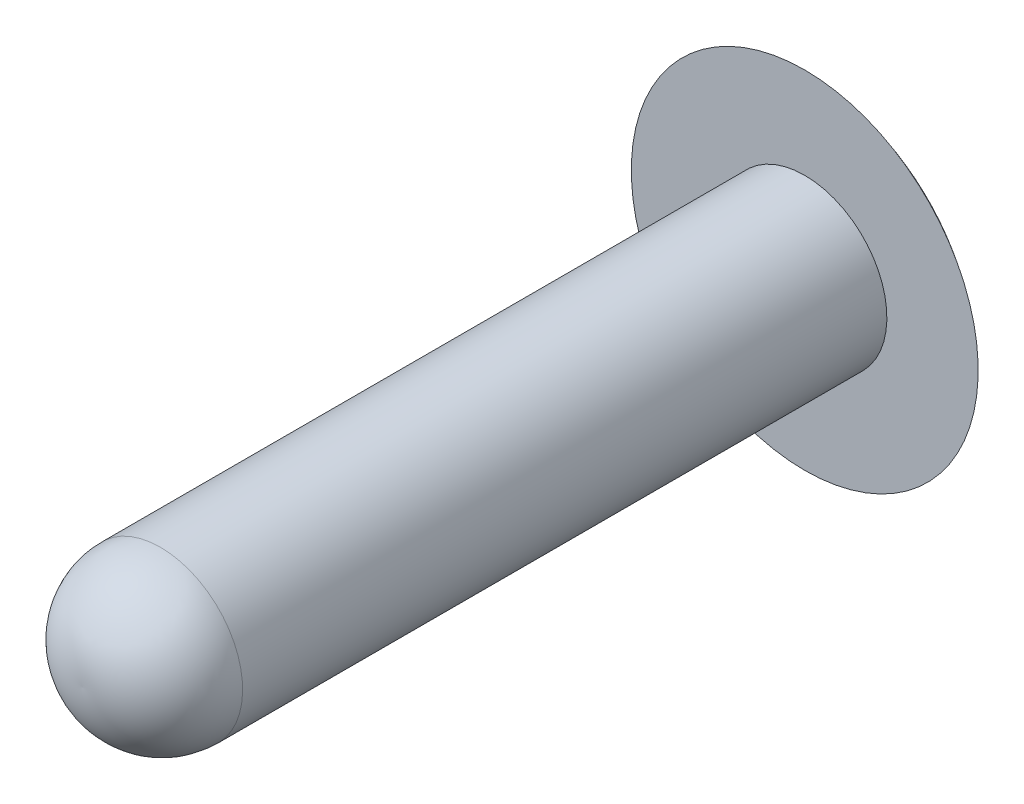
from build123d import *


with BuildPart() as part:
    # Croquis2 → Revoluci_n2 (revolve)
    with BuildSketch(Plane(origin=(0, 0, 0), x_dir=(0, 0, -1), z_dir=(1, 0, 0))):
        with BuildLine():
            Line((-7.397370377, -10.028383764), (17.30638197, -10.028383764))
            Line((17.30638197, -10.028383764), (17.30638197, -13.528383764))
            ThreePointArc((17.30638197, -13.528383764), (19.015143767, -10.396639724), (19.60638197, -6.878383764))
            Line((19.60638197, -6.878383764), (-10.39361803, -6.878383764))
            ThreePointArc((-10.39361803, -6.878383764), (-9.571076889, -9.095991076), (-7.397370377, -10.028383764))
        make_face()
    revolve(axis=Axis((0, -6.878383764, -19.60638197), (0, 0, 1)))


solid = part.part
